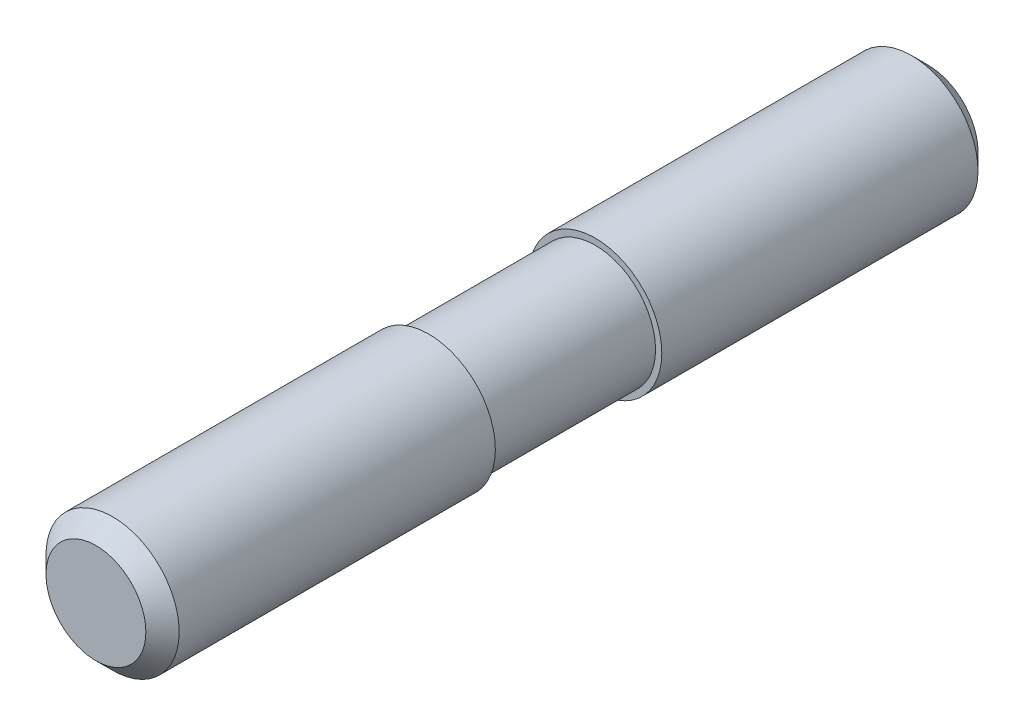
ISO-10303-21;
HEADER;
FILE_DESCRIPTION(('STEP AP214'),'2;1');
FILE_NAME('part.step','',(''),(''),'','','');
FILE_SCHEMA(('AUTOMOTIVE_DESIGN { 1 0 10303 214 1 1 1 1 }'));
ENDSEC;
DATA;
#1=APPLICATION_CONTEXT('core data for automotive mechanical design processes');
#2=APPLICATION_PROTOCOL_DEFINITION('international standard','automotive_design',2000,#1);
#3=PRODUCT_CONTEXT('',#1,'mechanical');
#4=PRODUCT('Part','Part','',(#3));
#5=PRODUCT_RELATED_PRODUCT_CATEGORY('part','',(#4));
#6=PRODUCT_DEFINITION_FORMATION('','',#4);
#7=PRODUCT_DEFINITION_CONTEXT('part definition',#1,'design');
#8=PRODUCT_DEFINITION('design','',#6,#7);
#9=PRODUCT_DEFINITION_SHAPE('','',#8);
#10=(LENGTH_UNIT() NAMED_UNIT(*) SI_UNIT(.MILLI.,.METRE.));
#11=(NAMED_UNIT(*) PLANE_ANGLE_UNIT() SI_UNIT($,.RADIAN.));
#12=(NAMED_UNIT(*) SI_UNIT($,.STERADIAN.) SOLID_ANGLE_UNIT());
#13=UNCERTAINTY_MEASURE_WITH_UNIT(LENGTH_MEASURE(1.E-05),#10,'distance_accuracy_value','');
#14=(GEOMETRIC_REPRESENTATION_CONTEXT(3) GLOBAL_UNCERTAINTY_ASSIGNED_CONTEXT((#13)) GLOBAL_UNIT_ASSIGNED_CONTEXT((#10,
#11,#12)) REPRESENTATION_CONTEXT('',''));
#15=CARTESIAN_POINT('',(0.,0.,0.));
#16=DIRECTION('',(0.,0.,1.));
#17=DIRECTION('',(1.,0.,0.));
#18=AXIS2_PLACEMENT_3D('',#15,#16,#17);
#19=CARTESIAN_POINT('',(0.,0.,0.));
#20=DIRECTION('',(0.,0.,1.));
#21=DIRECTION('',(1.,0.,0.));
#22=AXIS2_PLACEMENT_3D('',#19,#20,#21);
#23=PLANE('',#22);
#24=CARTESIAN_POINT('',(0.,0.,0.));
#25=DIRECTION('',(0.,0.,1.));
#26=DIRECTION('',(1.,0.,0.));
#27=AXIS2_PLACEMENT_3D('',#24,#25,#26);
#28=CIRCLE('',#27,6.);
#29=CARTESIAN_POINT('',(6.,0.,0.));
#30=VERTEX_POINT('',#29);
#31=EDGE_CURVE('E8',#30,#30,#28,.T.);
#32=ORIENTED_EDGE('',*,*,#31,.F.);
#33=EDGE_LOOP('',(#32));
#34=FACE_BOUND('',#33,.T.);
#35=ADVANCED_FACE('F12',(#34),#23,.F.);
#36=CARTESIAN_POINT('',(0.,0.,2.));
#37=DIRECTION('',(0.,0.,1.));
#38=DIRECTION('',(1.,0.,0.));
#39=AXIS2_PLACEMENT_3D('',#36,#37,#38);
#40=CONICAL_SURFACE('',#39,8.,0.785398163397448);
#41=ORIENTED_EDGE('',*,*,#31,.T.);
#42=EDGE_LOOP('',(#41));
#43=FACE_BOUND('',#42,.T.);
#44=CARTESIAN_POINT('',(0.,0.,2.));
#45=DIRECTION('',(0.,0.,1.));
#46=DIRECTION('',(1.,0.,0.));
#47=AXIS2_PLACEMENT_3D('',#44,#45,#46);
#48=CIRCLE('',#47,8.);
#49=CARTESIAN_POINT('',(8.,0.,2.));
#50=VERTEX_POINT('',#49);
#51=EDGE_CURVE('E18',#50,#50,#48,.T.);
#52=ORIENTED_EDGE('',*,*,#51,.F.);
#53=EDGE_LOOP('',(#52));
#54=FACE_BOUND('',#53,.T.);
#55=ADVANCED_FACE('F62',(#43,#54),#40,.T.);
#56=CARTESIAN_POINT('',(0.,0.,70.));
#57=DIRECTION('',(0.,0.,1.));
#58=DIRECTION('',(1.,0.,0.));
#59=AXIS2_PLACEMENT_3D('',#56,#57,#58);
#60=CYLINDRICAL_SURFACE('',#59,8.);
#61=CARTESIAN_POINT('',(0.,0.,40.));
#62=DIRECTION('',(0.,0.,1.));
#63=DIRECTION('',(1.,0.,0.));
#64=AXIS2_PLACEMENT_3D('',#61,#62,#63);
#65=CIRCLE('',#64,8.);
#66=CARTESIAN_POINT('',(8.,0.,40.));
#67=VERTEX_POINT('',#66);
#68=EDGE_CURVE('E22',#67,#67,#65,.T.);
#69=ORIENTED_EDGE('',*,*,#68,.F.);
#70=EDGE_LOOP('',(#69));
#71=FACE_BOUND('',#70,.T.);
#72=ORIENTED_EDGE('',*,*,#51,.T.);
#73=EDGE_LOOP('',(#72));
#74=FACE_BOUND('',#73,.T.);
#75=ADVANCED_FACE('F68',(#71,#74),#60,.T.);
#76=CARTESIAN_POINT('',(8.,0.,40.));
#77=DIRECTION('',(0.,0.,-1.));
#78=DIRECTION('',(-1.,0.,0.));
#79=AXIS2_PLACEMENT_3D('',#76,#77,#78);
#80=PLANE('',#79);
#81=CARTESIAN_POINT('',(0.,0.,40.));
#82=DIRECTION('',(0.,0.,1.));
#83=DIRECTION('',(1.,0.,0.));
#84=AXIS2_PLACEMENT_3D('',#81,#82,#83);
#85=CIRCLE('',#84,7.25);
#86=CARTESIAN_POINT('',(7.25,0.,40.));
#87=VERTEX_POINT('',#86);
#88=EDGE_CURVE('E26',#87,#87,#85,.T.);
#89=ORIENTED_EDGE('',*,*,#88,.F.);
#90=EDGE_LOOP('',(#89));
#91=FACE_BOUND('',#90,.T.);
#92=ORIENTED_EDGE('',*,*,#68,.T.);
#93=EDGE_LOOP('',(#92));
#94=FACE_BOUND('',#93,.T.);
#95=ADVANCED_FACE('F73',(#91,#94),#80,.F.);
#96=CARTESIAN_POINT('',(0.,0.,70.));
#97=DIRECTION('',(0.,0.,1.));
#98=DIRECTION('',(1.,0.,0.));
#99=AXIS2_PLACEMENT_3D('',#96,#97,#98);
#100=CYLINDRICAL_SURFACE('',#99,7.25);
#101=CARTESIAN_POINT('',(0.,0.,60.));
#102=DIRECTION('',(0.,0.,1.));
#103=DIRECTION('',(1.,0.,0.));
#104=AXIS2_PLACEMENT_3D('',#101,#102,#103);
#105=CIRCLE('',#104,7.25);
#106=CARTESIAN_POINT('',(7.25,0.,60.));
#107=VERTEX_POINT('',#106);
#108=EDGE_CURVE('E31',#107,#107,#105,.T.);
#109=ORIENTED_EDGE('',*,*,#108,.F.);
#110=EDGE_LOOP('',(#109));
#111=FACE_BOUND('',#110,.T.);
#112=ORIENTED_EDGE('',*,*,#88,.T.);
#113=EDGE_LOOP('',(#112));
#114=FACE_BOUND('',#113,.T.);
#115=ADVANCED_FACE('F80',(#111,#114),#100,.T.);
#116=CARTESIAN_POINT('',(7.25,0.,60.));
#117=DIRECTION('',(0.,0.,1.));
#118=DIRECTION('',(1.,0.,0.));
#119=AXIS2_PLACEMENT_3D('',#116,#117,#118);
#120=PLANE('',#119);
#121=CARTESIAN_POINT('',(0.,0.,60.));
#122=DIRECTION('',(0.,0.,1.));
#123=DIRECTION('',(1.,0.,0.));
#124=AXIS2_PLACEMENT_3D('',#121,#122,#123);
#125=CIRCLE('',#124,8.);
#126=CARTESIAN_POINT('',(8.,0.,60.));
#127=VERTEX_POINT('',#126);
#128=EDGE_CURVE('E34',#127,#127,#125,.T.);
#129=ORIENTED_EDGE('',*,*,#128,.F.);
#130=EDGE_LOOP('',(#129));
#131=FACE_BOUND('',#130,.T.);
#132=ORIENTED_EDGE('',*,*,#108,.T.);
#133=EDGE_LOOP('',(#132));
#134=FACE_BOUND('',#133,.T.);
#135=ADVANCED_FACE('F58',(#131,#134),#120,.F.);
#136=CARTESIAN_POINT('',(0.,0.,70.));
#137=DIRECTION('',(0.,0.,1.));
#138=DIRECTION('',(1.,0.,0.));
#139=AXIS2_PLACEMENT_3D('',#136,#137,#138);
#140=CYLINDRICAL_SURFACE('',#139,8.);
#141=CARTESIAN_POINT('',(0.,0.,98.));
#142=DIRECTION('',(0.,0.,1.));
#143=DIRECTION('',(1.,0.,0.));
#144=AXIS2_PLACEMENT_3D('',#141,#142,#143);
#145=CIRCLE('',#144,8.);
#146=CARTESIAN_POINT('',(8.,0.,98.));
#147=VERTEX_POINT('',#146);
#148=EDGE_CURVE('E37',#147,#147,#145,.T.);
#149=ORIENTED_EDGE('',*,*,#148,.F.);
#150=EDGE_LOOP('',(#149));
#151=FACE_BOUND('',#150,.T.);
#152=ORIENTED_EDGE('',*,*,#128,.T.);
#153=EDGE_LOOP('',(#152));
#154=FACE_BOUND('',#153,.T.);
#155=ADVANCED_FACE('F48',(#151,#154),#140,.T.);
#156=CARTESIAN_POINT('',(0.,0.,100.));
#157=DIRECTION('',(0.,0.,-1.));
#158=DIRECTION('',(-1.,0.,0.));
#159=AXIS2_PLACEMENT_3D('',#156,#157,#158);
#160=CONICAL_SURFACE('',#159,6.,0.785398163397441);
#161=ORIENTED_EDGE('',*,*,#148,.T.);
#162=EDGE_LOOP('',(#161));
#163=FACE_BOUND('',#162,.T.);
#164=CARTESIAN_POINT('',(0.,0.,100.));
#165=DIRECTION('',(0.,0.,1.));
#166=DIRECTION('',(1.,0.,0.));
#167=AXIS2_PLACEMENT_3D('',#164,#165,#166);
#168=CIRCLE('',#167,6.);
#169=CARTESIAN_POINT('',(6.,0.,100.));
#170=VERTEX_POINT('',#169);
#171=EDGE_CURVE('E40',#170,#170,#168,.T.);
#172=ORIENTED_EDGE('',*,*,#171,.F.);
#173=EDGE_LOOP('',(#172));
#174=FACE_BOUND('',#173,.T.);
#175=ADVANCED_FACE('F46',(#163,#174),#160,.T.);
#176=CARTESIAN_POINT('',(6.,0.,100.));
#177=DIRECTION('',(0.,0.,-1.));
#178=DIRECTION('',(-1.,0.,0.));
#179=AXIS2_PLACEMENT_3D('',#176,#177,#178);
#180=PLANE('',#179);
#181=ORIENTED_EDGE('',*,*,#171,.T.);
#182=EDGE_LOOP('',(#181));
#183=FACE_BOUND('',#182,.T.);
#184=ADVANCED_FACE('F44',(#183),#180,.F.);
#185=CLOSED_SHELL('',(#35,#55,#75,#95,#115,#135,#155,#175,#184));
#186=MANIFOLD_SOLID_BREP('B1',#185);
#187=ADVANCED_BREP_SHAPE_REPRESENTATION('',(#18,#186),#14);
#188=SHAPE_DEFINITION_REPRESENTATION(#9,#187);
ENDSEC;
END-ISO-10303-21;
